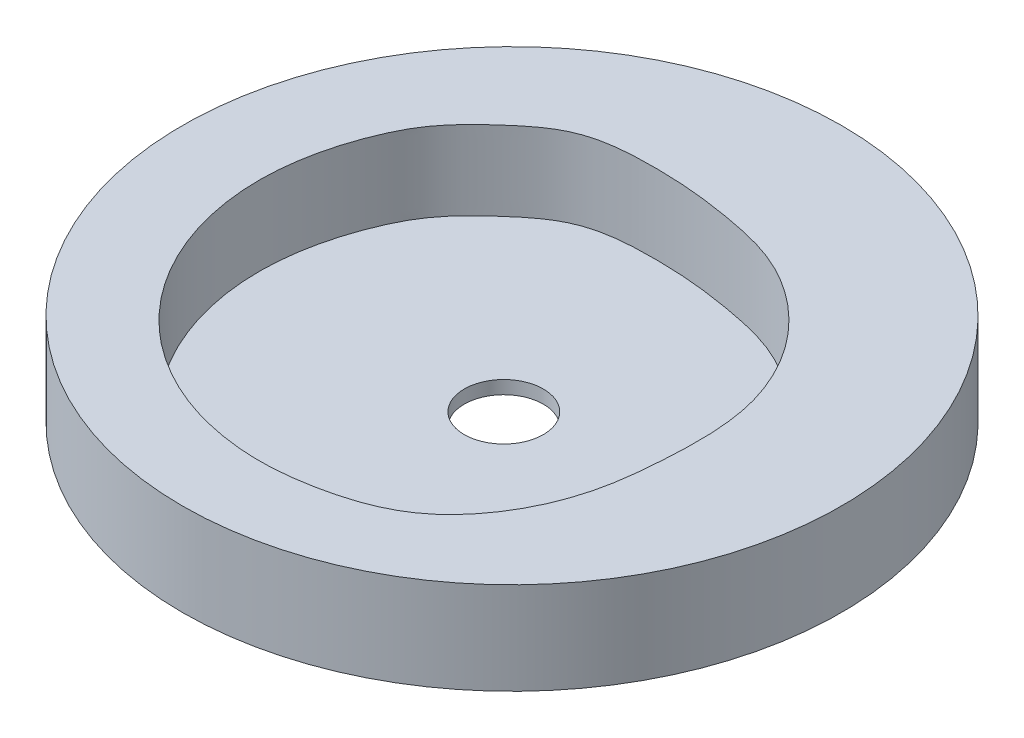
from build123d import *

# Parameters (mm, degrees)
SZKIC1_R                    = 250
SZKIC1_R_2                  = 30
DODANIE_WYCI_GNI_CIE1_DEPTH = 70
WYTNIJ_WYCI_GNI_CIE1_START  = -60
SZKIC2_R                    = 30
WYTNIJ_WYCI_GNI_CIE1_DEPTH  = 60


with BuildPart() as part:
    # Szkic1 → Dodanie-wyci_gni_cie1 (new body)
    with BuildSketch(Plane(origin=(0, 0, 0), x_dir=(1, 0, 0), z_dir=(0, 1, 0))):
        with Locations(Location((0, 0, 0), (0, 0, 270))):
            Circle(SZKIC1_R)
        with Locations(Location((0, -6.206475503, 0), (0, 0, 270))):
            Circle(SZKIC1_R_2, mode=Mode.SUBTRACT)
    extrude(amount=DODANIE_WYCI_GNI_CIE1_DEPTH)

    # Szkic2 → Wytnij-wyci_gni_cie1 (cut)
    with BuildSketch(Plane(origin=(0, 70, 0), x_dir=(1, 0, 0), z_dir=(0, 1, 0)).offset(WYTNIJ_WYCI_GNI_CIE1_START)):
        with BuildLine():
            add(Edge.make_bspline(
                [(-45.060876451, -185.634782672), (-33.288498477, -188.586789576), (-18.188260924, -190.825902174), (10.396877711, -191.552627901), (45.17829971, -187.313362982), (93.505906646, -171.674474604), (123.455959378, -137.177404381), (139.008900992, -106.533643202), (148.590100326, -76.421798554), (153.343669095, -29.760031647), (154.100642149, 26.69144337), (130.171327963, 79.040726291), (97.132028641, 114.958515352), (59.616027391, 137.137735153), (21.836127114, 145.593183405), (-12.790429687, 150.802289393), (-52.294837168, 152.275526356), (-96.21890416, 148.958422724), (-130.914540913, 120.672762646), (-156.629334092, 95.406701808), (-177.618482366, 52.471412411), (-189.644046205, -3.161009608), (-177.606421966, -69.045212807), (-150.210326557, -118.111145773), (-115.082331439, -153.500072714), (-79.696696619, -174.719087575), (-54.922922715, -183.161804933), (-45.060876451, -185.634782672)],
                knots=[0, 0, 0, 0, 0.033549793, 0.041943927, 0.079097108, 0.130409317, 0.178137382, 0.200597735, 0.22554292, 0.264982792, 0.330361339, 0.378658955, 0.420200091, 0.46403346, 0.496717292, 0.526820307, 0.560725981, 0.606915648, 0.643458, 0.681534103, 0.705910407, 0.774648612, 0.835102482, 0.88717127, 0.927826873, 0.971894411, 1, 1, 1, 1], degree=3))
        make_face()
        with Locations(Location((0, -6.206475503, 0), (0, 0, 270))):
            Circle(SZKIC2_R, mode=Mode.SUBTRACT)
    extrude(amount=WYTNIJ_WYCI_GNI_CIE1_DEPTH, mode=Mode.SUBTRACT)


solid = part.part
